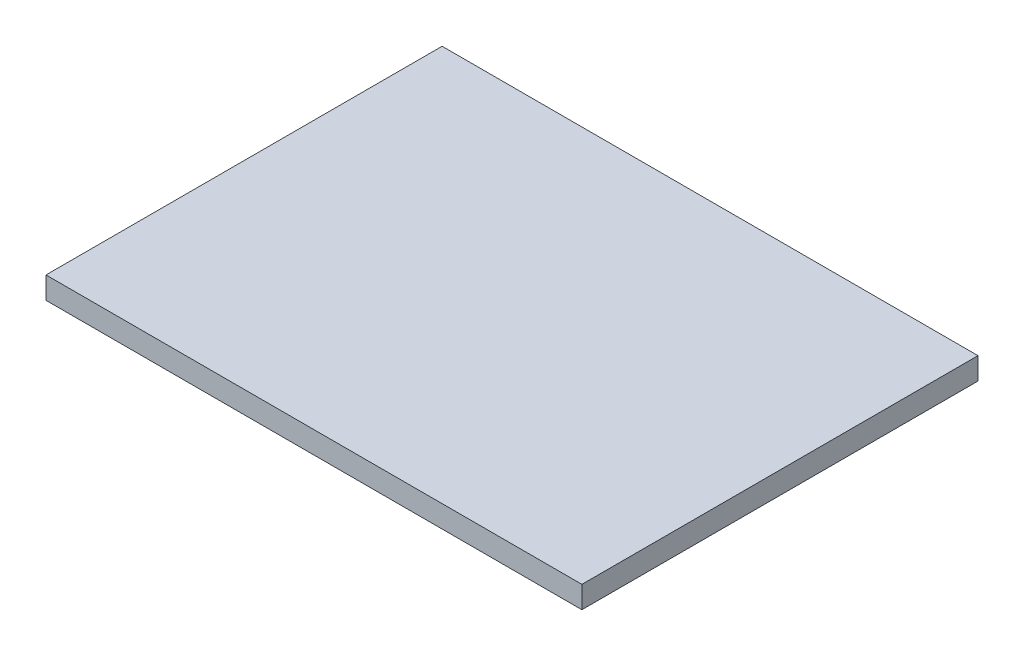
ISO-10303-21;
HEADER;
FILE_DESCRIPTION(('STEP AP214'),'2;1');
FILE_NAME('part.step','',(''),(''),'','','');
FILE_SCHEMA(('AUTOMOTIVE_DESIGN { 1 0 10303 214 1 1 1 1 }'));
ENDSEC;
DATA;
#1=APPLICATION_CONTEXT('core data for automotive mechanical design processes');
#2=APPLICATION_PROTOCOL_DEFINITION('international standard','automotive_design',2000,#1);
#3=PRODUCT_CONTEXT('',#1,'mechanical');
#4=PRODUCT('Part','Part','',(#3));
#5=PRODUCT_RELATED_PRODUCT_CATEGORY('part','',(#4));
#6=PRODUCT_DEFINITION_FORMATION('','',#4);
#7=PRODUCT_DEFINITION_CONTEXT('part definition',#1,'design');
#8=PRODUCT_DEFINITION('design','',#6,#7);
#9=PRODUCT_DEFINITION_SHAPE('','',#8);
#10=(LENGTH_UNIT() NAMED_UNIT(*) SI_UNIT(.MILLI.,.METRE.));
#11=(NAMED_UNIT(*) PLANE_ANGLE_UNIT() SI_UNIT($,.RADIAN.));
#12=(NAMED_UNIT(*) SI_UNIT($,.STERADIAN.) SOLID_ANGLE_UNIT());
#13=UNCERTAINTY_MEASURE_WITH_UNIT(LENGTH_MEASURE(1.E-05),#10,'distance_accuracy_value','');
#14=(GEOMETRIC_REPRESENTATION_CONTEXT(3) GLOBAL_UNCERTAINTY_ASSIGNED_CONTEXT((#13)) GLOBAL_UNIT_ASSIGNED_CONTEXT((#10,
#11,#12)) REPRESENTATION_CONTEXT('',''));
#15=CARTESIAN_POINT('',(0.,0.,0.));
#16=DIRECTION('',(0.,0.,1.));
#17=DIRECTION('',(1.,0.,0.));
#18=AXIS2_PLACEMENT_3D('',#15,#16,#17);
#19=CARTESIAN_POINT('',(14.605,1.2,0.));
#20=DIRECTION('',(-1.,0.,0.));
#21=DIRECTION('',(0.,0.,1.));
#22=AXIS2_PLACEMENT_3D('',#19,#20,#21);
#23=PLANE('',#22);
#24=DIRECTION('',(0.,0.,-1.));
#25=VECTOR('',#24,1.);
#26=CARTESIAN_POINT('',(14.605,0.,0.));
#27=LINE('',#26,#25);
#28=CARTESIAN_POINT('',(14.605,0.,0.));
#29=VERTEX_POINT('',#28);
#30=CARTESIAN_POINT('',(14.605,0.,-21.59));
#31=VERTEX_POINT('',#30);
#32=EDGE_CURVE('E105',#29,#31,#27,.T.);
#33=ORIENTED_EDGE('',*,*,#32,.T.);
#34=DIRECTION('',(0.,-1.,0.));
#35=VECTOR('',#34,1.);
#36=CARTESIAN_POINT('',(14.605,1.2,-21.59));
#37=LINE('',#36,#35);
#38=CARTESIAN_POINT('',(14.605,1.2,-21.59));
#39=VERTEX_POINT('',#38);
#40=EDGE_CURVE('E11',#39,#31,#37,.T.);
#41=ORIENTED_EDGE('',*,*,#40,.F.);
#42=DIRECTION('',(0.,0.,-1.));
#43=VECTOR('',#42,1.);
#44=CARTESIAN_POINT('',(14.605,1.2,0.));
#45=LINE('',#44,#43);
#46=CARTESIAN_POINT('',(14.605,1.2,0.));
#47=VERTEX_POINT('',#46);
#48=EDGE_CURVE('E93',#47,#39,#45,.T.);
#49=ORIENTED_EDGE('',*,*,#48,.F.);
#50=DIRECTION('',(0.,-1.,0.));
#51=VECTOR('',#50,1.);
#52=CARTESIAN_POINT('',(14.605,1.2,0.));
#53=LINE('',#52,#51);
#54=EDGE_CURVE('E101',#47,#29,#53,.T.);
#55=ORIENTED_EDGE('',*,*,#54,.T.);
#56=EDGE_LOOP('',(#33,#41,#49,#55));
#57=FACE_BOUND('',#56,.T.);
#58=ADVANCED_FACE('F42',(#57),#23,.F.);
#59=CARTESIAN_POINT('',(-14.605,1.2,-21.59));
#60=DIRECTION('',(0.,0.,1.));
#61=DIRECTION('',(1.,0.,0.));
#62=AXIS2_PLACEMENT_3D('',#59,#60,#61);
#63=PLANE('',#62);
#64=DIRECTION('',(-1.,0.,0.));
#65=VECTOR('',#64,1.);
#66=CARTESIAN_POINT('',(-14.605,0.,-21.59));
#67=LINE('',#66,#65);
#68=CARTESIAN_POINT('',(-14.605,0.,-21.59));
#69=VERTEX_POINT('',#68);
#70=EDGE_CURVE('E97',#31,#69,#67,.T.);
#71=ORIENTED_EDGE('',*,*,#70,.T.);
#72=DIRECTION('',(0.,-1.,0.));
#73=VECTOR('',#72,1.);
#74=CARTESIAN_POINT('',(-14.605,1.2,-21.59));
#75=LINE('',#74,#73);
#76=CARTESIAN_POINT('',(-14.605,1.2,-21.59));
#77=VERTEX_POINT('',#76);
#78=EDGE_CURVE('E50',#77,#69,#75,.T.);
#79=ORIENTED_EDGE('',*,*,#78,.F.);
#80=DIRECTION('',(-1.,0.,0.));
#81=VECTOR('',#80,1.);
#82=CARTESIAN_POINT('',(-14.605,1.2,-21.59));
#83=LINE('',#82,#81);
#84=EDGE_CURVE('E88',#39,#77,#83,.T.);
#85=ORIENTED_EDGE('',*,*,#84,.F.);
#86=ORIENTED_EDGE('',*,*,#40,.T.);
#87=EDGE_LOOP('',(#71,#79,#85,#86));
#88=FACE_BOUND('',#87,.T.);
#89=ADVANCED_FACE('F96',(#88),#63,.F.);
#90=CARTESIAN_POINT('',(-14.605,1.2,0.));
#91=DIRECTION('',(1.,0.,0.));
#92=DIRECTION('',(0.,0.,-1.));
#93=AXIS2_PLACEMENT_3D('',#90,#91,#92);
#94=PLANE('',#93);
#95=DIRECTION('',(0.,0.,1.));
#96=VECTOR('',#95,1.);
#97=CARTESIAN_POINT('',(-14.605,0.,0.));
#98=LINE('',#97,#96);
#99=CARTESIAN_POINT('',(-14.605,0.,0.));
#100=VERTEX_POINT('',#99);
#101=EDGE_CURVE('E75',#69,#100,#98,.T.);
#102=ORIENTED_EDGE('',*,*,#101,.T.);
#103=DIRECTION('',(0.,-1.,0.));
#104=VECTOR('',#103,1.);
#105=CARTESIAN_POINT('',(-14.605,1.2,0.));
#106=LINE('',#105,#104);
#107=CARTESIAN_POINT('',(-14.605,1.2,0.));
#108=VERTEX_POINT('',#107);
#109=EDGE_CURVE('E98',#108,#100,#106,.T.);
#110=ORIENTED_EDGE('',*,*,#109,.F.);
#111=DIRECTION('',(0.,0.,1.));
#112=VECTOR('',#111,1.);
#113=CARTESIAN_POINT('',(-14.605,1.2,0.));
#114=LINE('',#113,#112);
#115=EDGE_CURVE('E91',#77,#108,#114,.T.);
#116=ORIENTED_EDGE('',*,*,#115,.F.);
#117=ORIENTED_EDGE('',*,*,#78,.T.);
#118=EDGE_LOOP('',(#102,#110,#116,#117));
#119=FACE_BOUND('',#118,.T.);
#120=ADVANCED_FACE('F99',(#119),#94,.F.);
#121=CARTESIAN_POINT('',(-14.605,1.2,0.));
#122=DIRECTION('',(0.,0.,-1.));
#123=DIRECTION('',(-1.,0.,0.));
#124=AXIS2_PLACEMENT_3D('',#121,#122,#123);
#125=PLANE('',#124);
#126=DIRECTION('',(1.,0.,0.));
#127=VECTOR('',#126,1.);
#128=CARTESIAN_POINT('',(-14.605,0.,0.));
#129=LINE('',#128,#127);
#130=EDGE_CURVE('E81',#100,#29,#129,.T.);
#131=ORIENTED_EDGE('',*,*,#130,.T.);
#132=ORIENTED_EDGE('',*,*,#54,.F.);
#133=DIRECTION('',(1.,0.,0.));
#134=VECTOR('',#133,1.);
#135=CARTESIAN_POINT('',(-14.605,1.2,0.));
#136=LINE('',#135,#134);
#137=EDGE_CURVE('E58',#108,#47,#136,.T.);
#138=ORIENTED_EDGE('',*,*,#137,.F.);
#139=ORIENTED_EDGE('',*,*,#109,.T.);
#140=EDGE_LOOP('',(#131,#132,#138,#139));
#141=FACE_BOUND('',#140,.T.);
#142=ADVANCED_FACE('F112',(#141),#125,.F.);
#143=CARTESIAN_POINT('',(0.,1.2,0.));
#144=DIRECTION('',(0.,-1.,0.));
#145=DIRECTION('',(0.,0.,-1.));
#146=AXIS2_PLACEMENT_3D('',#143,#144,#145);
#147=PLANE('',#146);
#148=ORIENTED_EDGE('',*,*,#48,.T.);
#149=ORIENTED_EDGE('',*,*,#84,.T.);
#150=ORIENTED_EDGE('',*,*,#115,.T.);
#151=ORIENTED_EDGE('',*,*,#137,.T.);
#152=EDGE_LOOP('',(#148,#149,#150,#151));
#153=FACE_BOUND('',#152,.T.);
#154=ADVANCED_FACE('F89',(#153),#147,.F.);
#155=CARTESIAN_POINT('',(0.,0.,0.));
#156=DIRECTION('',(0.,-1.,0.));
#157=DIRECTION('',(0.,0.,-1.));
#158=AXIS2_PLACEMENT_3D('',#155,#156,#157);
#159=PLANE('',#158);
#160=ORIENTED_EDGE('',*,*,#32,.F.);
#161=ORIENTED_EDGE('',*,*,#130,.F.);
#162=ORIENTED_EDGE('',*,*,#101,.F.);
#163=ORIENTED_EDGE('',*,*,#70,.F.);
#164=EDGE_LOOP('',(#160,#161,#162,#163));
#165=FACE_BOUND('',#164,.T.);
#166=ADVANCED_FACE('F115',(#165),#159,.T.);
#167=CLOSED_SHELL('',(#58,#89,#120,#142,#154,#166));
#168=MANIFOLD_SOLID_BREP('B2',#167);
#169=ADVANCED_BREP_SHAPE_REPRESENTATION('',(#18,#168),#14);
#170=SHAPE_DEFINITION_REPRESENTATION(#9,#169);
ENDSEC;
END-ISO-10303-21;
